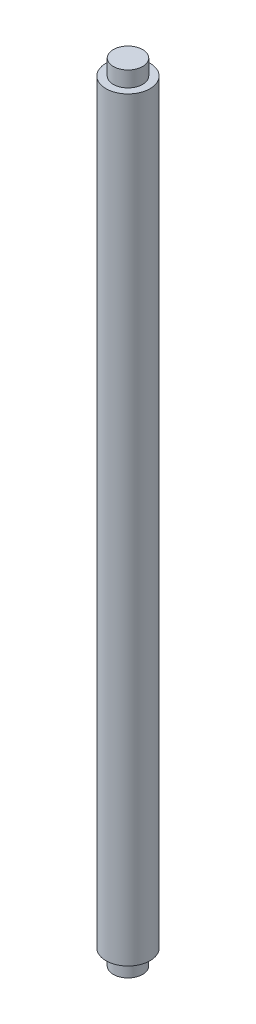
ISO-10303-21;
HEADER;
FILE_DESCRIPTION(('STEP AP214'),'2;1');
FILE_NAME('part.step','',(''),(''),'','','');
FILE_SCHEMA(('AUTOMOTIVE_DESIGN { 1 0 10303 214 1 1 1 1 }'));
ENDSEC;
DATA;
#1=APPLICATION_CONTEXT('core data for automotive mechanical design processes');
#2=APPLICATION_PROTOCOL_DEFINITION('international standard','automotive_design',2000,#1);
#3=PRODUCT_CONTEXT('',#1,'mechanical');
#4=PRODUCT('Part','Part','',(#3));
#5=PRODUCT_RELATED_PRODUCT_CATEGORY('part','',(#4));
#6=PRODUCT_DEFINITION_FORMATION('','',#4);
#7=PRODUCT_DEFINITION_CONTEXT('part definition',#1,'design');
#8=PRODUCT_DEFINITION('design','',#6,#7);
#9=PRODUCT_DEFINITION_SHAPE('','',#8);
#10=(LENGTH_UNIT() NAMED_UNIT(*) SI_UNIT(.MILLI.,.METRE.));
#11=(NAMED_UNIT(*) PLANE_ANGLE_UNIT() SI_UNIT($,.RADIAN.));
#12=(NAMED_UNIT(*) SI_UNIT($,.STERADIAN.) SOLID_ANGLE_UNIT());
#13=UNCERTAINTY_MEASURE_WITH_UNIT(LENGTH_MEASURE(1.E-05),#10,'distance_accuracy_value','');
#14=(GEOMETRIC_REPRESENTATION_CONTEXT(3) GLOBAL_UNCERTAINTY_ASSIGNED_CONTEXT((#13)) GLOBAL_UNIT_ASSIGNED_CONTEXT((#10,
#11,#12)) REPRESENTATION_CONTEXT('',''));
#15=CARTESIAN_POINT('',(0.,0.,0.));
#16=DIRECTION('',(0.,0.,1.));
#17=DIRECTION('',(1.,0.,0.));
#18=AXIS2_PLACEMENT_3D('',#15,#16,#17);
#19=CARTESIAN_POINT('',(0.,77.1,0.));
#20=DIRECTION('',(0.,-1.,0.));
#21=DIRECTION('',(0.,0.,-1.));
#22=AXIS2_PLACEMENT_3D('',#19,#20,#21);
#23=CYLINDRICAL_SURFACE('',#22,2.25);
#24=CARTESIAN_POINT('',(0.,77.1,0.));
#25=DIRECTION('',(0.,1.,0.));
#26=DIRECTION('',(0.,0.,1.));
#27=AXIS2_PLACEMENT_3D('',#24,#25,#26);
#28=CIRCLE('',#27,2.25);
#29=CARTESIAN_POINT('',(0.,77.1,2.25));
#30=VERTEX_POINT('',#29);
#31=EDGE_CURVE('E60',#30,#30,#28,.T.);
#32=ORIENTED_EDGE('',*,*,#31,.F.);
#33=EDGE_LOOP('',(#32));
#34=FACE_BOUND('',#33,.T.);
#35=CARTESIAN_POINT('',(0.,0.,0.));
#36=DIRECTION('',(0.,1.,0.));
#37=DIRECTION('',(0.,0.,1.));
#38=AXIS2_PLACEMENT_3D('',#35,#36,#37);
#39=CIRCLE('',#38,2.25);
#40=CARTESIAN_POINT('',(0.,0.,2.25));
#41=VERTEX_POINT('',#40);
#42=EDGE_CURVE('E48',#41,#41,#39,.T.);
#43=ORIENTED_EDGE('',*,*,#42,.T.);
#44=EDGE_LOOP('',(#43));
#45=FACE_BOUND('',#44,.T.);
#46=ADVANCED_FACE('F45',(#34,#45),#23,.T.);
#47=CARTESIAN_POINT('',(0.,77.1,0.));
#48=DIRECTION('',(0.,1.,0.));
#49=DIRECTION('',(0.,0.,1.));
#50=AXIS2_PLACEMENT_3D('',#47,#48,#49);
#51=PLANE('',#50);
#52=CARTESIAN_POINT('',(0.,77.1,0.));
#53=DIRECTION('',(0.,1.,0.));
#54=DIRECTION('',(0.,0.,1.));
#55=AXIS2_PLACEMENT_3D('',#52,#53,#54);
#56=CIRCLE('',#55,1.5);
#57=CARTESIAN_POINT('',(0.,77.1,1.5));
#58=VERTEX_POINT('',#57);
#59=EDGE_CURVE('E10',#58,#58,#56,.T.);
#60=ORIENTED_EDGE('',*,*,#59,.F.);
#61=EDGE_LOOP('',(#60));
#62=FACE_BOUND('',#61,.T.);
#63=ORIENTED_EDGE('',*,*,#31,.T.);
#64=EDGE_LOOP('',(#63));
#65=FACE_BOUND('',#64,.T.);
#66=ADVANCED_FACE('F82',(#62,#65),#51,.T.);
#67=CARTESIAN_POINT('',(0.,0.,0.));
#68=DIRECTION('',(0.,1.,0.));
#69=DIRECTION('',(0.,0.,1.));
#70=AXIS2_PLACEMENT_3D('',#67,#68,#69);
#71=PLANE('',#70);
#72=CARTESIAN_POINT('',(0.,0.,0.));
#73=DIRECTION('',(0.,-1.,0.));
#74=DIRECTION('',(0.,0.,-1.));
#75=AXIS2_PLACEMENT_3D('',#72,#73,#74);
#76=CIRCLE('',#75,1.5);
#77=CARTESIAN_POINT('',(0.,0.,-1.5));
#78=VERTEX_POINT('',#77);
#79=EDGE_CURVE('E53',#78,#78,#76,.T.);
#80=ORIENTED_EDGE('',*,*,#79,.F.);
#81=EDGE_LOOP('',(#80));
#82=FACE_BOUND('',#81,.T.);
#83=ORIENTED_EDGE('',*,*,#42,.F.);
#84=EDGE_LOOP('',(#83));
#85=FACE_BOUND('',#84,.T.);
#86=ADVANCED_FACE('F79',(#82,#85),#71,.F.);
#87=CARTESIAN_POINT('',(0.,-1.5875,0.));
#88=DIRECTION('',(0.,1.,0.));
#89=DIRECTION('',(0.,0.,1.));
#90=AXIS2_PLACEMENT_3D('',#87,#88,#89);
#91=CYLINDRICAL_SURFACE('',#90,1.5);
#92=CARTESIAN_POINT('',(0.,-1.5875,0.));
#93=DIRECTION('',(0.,-1.,0.));
#94=DIRECTION('',(0.,0.,-1.));
#95=AXIS2_PLACEMENT_3D('',#92,#93,#94);
#96=CIRCLE('',#95,1.5);
#97=CARTESIAN_POINT('',(0.,-1.5875,-1.5));
#98=VERTEX_POINT('',#97);
#99=EDGE_CURVE('E65',#98,#98,#96,.T.);
#100=ORIENTED_EDGE('',*,*,#99,.F.);
#101=EDGE_LOOP('',(#100));
#102=FACE_BOUND('',#101,.T.);
#103=ORIENTED_EDGE('',*,*,#79,.T.);
#104=EDGE_LOOP('',(#103));
#105=FACE_BOUND('',#104,.T.);
#106=ADVANCED_FACE('F81',(#102,#105),#91,.T.);
#107=CARTESIAN_POINT('',(0.,-1.5875,0.));
#108=DIRECTION('',(0.,-1.,0.));
#109=DIRECTION('',(0.,0.,-1.));
#110=AXIS2_PLACEMENT_3D('',#107,#108,#109);
#111=PLANE('',#110);
#112=ORIENTED_EDGE('',*,*,#99,.T.);
#113=EDGE_LOOP('',(#112));
#114=FACE_BOUND('',#113,.T.);
#115=ADVANCED_FACE('F88',(#114),#111,.T.);
#116=CARTESIAN_POINT('',(0.,78.6875,0.));
#117=DIRECTION('',(0.,-1.,0.));
#118=DIRECTION('',(0.,0.,-1.));
#119=AXIS2_PLACEMENT_3D('',#116,#117,#118);
#120=CYLINDRICAL_SURFACE('',#119,1.5);
#121=CARTESIAN_POINT('',(0.,78.6875,0.));
#122=DIRECTION('',(0.,1.,0.));
#123=DIRECTION('',(0.,0.,1.));
#124=AXIS2_PLACEMENT_3D('',#121,#122,#123);
#125=CIRCLE('',#124,1.5);
#126=CARTESIAN_POINT('',(0.,78.6875,1.5));
#127=VERTEX_POINT('',#126);
#128=EDGE_CURVE('E64',#127,#127,#125,.T.);
#129=ORIENTED_EDGE('',*,*,#128,.F.);
#130=EDGE_LOOP('',(#129));
#131=FACE_BOUND('',#130,.T.);
#132=ORIENTED_EDGE('',*,*,#59,.T.);
#133=EDGE_LOOP('',(#132));
#134=FACE_BOUND('',#133,.T.);
#135=ADVANCED_FACE('F125',(#131,#134),#120,.T.);
#136=CARTESIAN_POINT('',(0.,78.6875,0.));
#137=DIRECTION('',(0.,1.,0.));
#138=DIRECTION('',(0.,0.,1.));
#139=AXIS2_PLACEMENT_3D('',#136,#137,#138);
#140=PLANE('',#139);
#141=ORIENTED_EDGE('',*,*,#128,.T.);
#142=EDGE_LOOP('',(#141));
#143=FACE_BOUND('',#142,.T.);
#144=ADVANCED_FACE('F134',(#143),#140,.T.);
#145=CLOSED_SHELL('',(#46,#66,#86,#106,#115,#135,#144));
#146=MANIFOLD_SOLID_BREP('B2',#145);
#147=ADVANCED_BREP_SHAPE_REPRESENTATION('',(#18,#146),#14);
#148=SHAPE_DEFINITION_REPRESENTATION(#9,#147);
ENDSEC;
END-ISO-10303-21;
